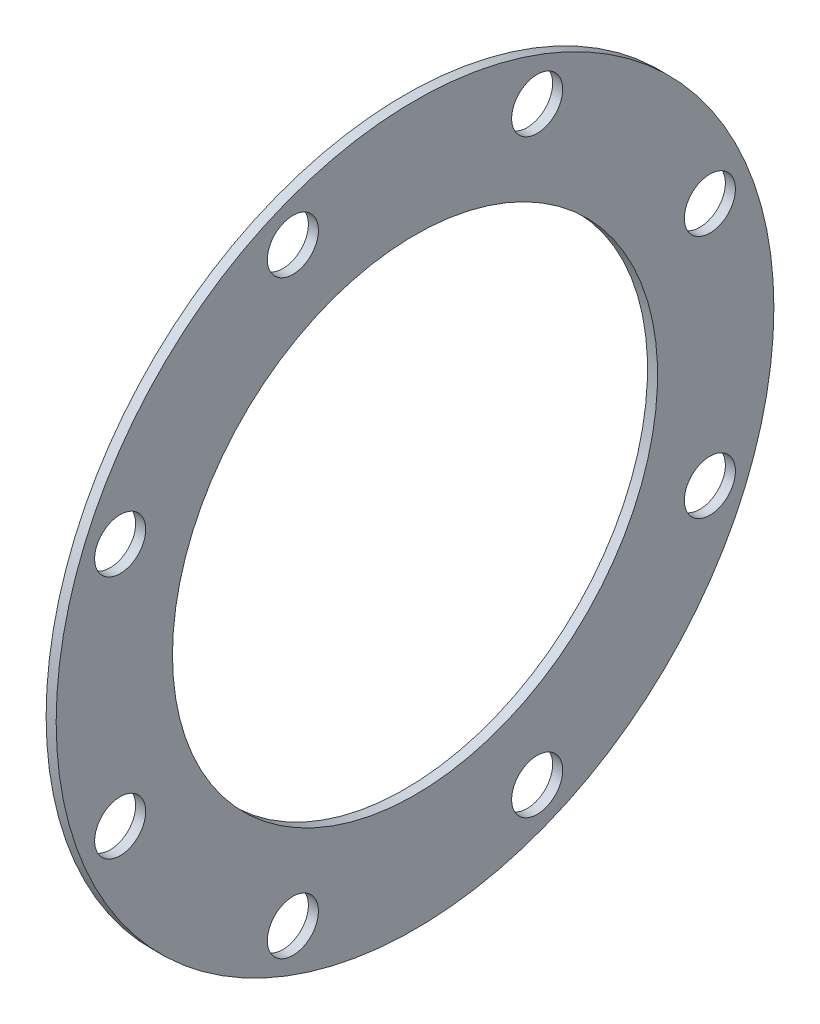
ISO-10303-21;
HEADER;
FILE_DESCRIPTION(('STEP AP214'),'2;1');
FILE_NAME('part.step','',(''),(''),'','','');
FILE_SCHEMA(('AUTOMOTIVE_DESIGN { 1 0 10303 214 1 1 1 1 }'));
ENDSEC;
DATA;
#1=APPLICATION_CONTEXT('core data for automotive mechanical design processes');
#2=APPLICATION_PROTOCOL_DEFINITION('international standard','automotive_design',2000,#1);
#3=PRODUCT_CONTEXT('',#1,'mechanical');
#4=PRODUCT('Part','Part','',(#3));
#5=PRODUCT_RELATED_PRODUCT_CATEGORY('part','',(#4));
#6=PRODUCT_DEFINITION_FORMATION('','',#4);
#7=PRODUCT_DEFINITION_CONTEXT('part definition',#1,'design');
#8=PRODUCT_DEFINITION('design','',#6,#7);
#9=PRODUCT_DEFINITION_SHAPE('','',#8);
#10=(LENGTH_UNIT() NAMED_UNIT(*) SI_UNIT(.MILLI.,.METRE.));
#11=(NAMED_UNIT(*) PLANE_ANGLE_UNIT() SI_UNIT($,.RADIAN.));
#12=(NAMED_UNIT(*) SI_UNIT($,.STERADIAN.) SOLID_ANGLE_UNIT());
#13=UNCERTAINTY_MEASURE_WITH_UNIT(LENGTH_MEASURE(1.E-05),#10,'distance_accuracy_value','');
#14=(GEOMETRIC_REPRESENTATION_CONTEXT(3) GLOBAL_UNCERTAINTY_ASSIGNED_CONTEXT((#13)) GLOBAL_UNIT_ASSIGNED_CONTEXT((#10,
#11,#12)) REPRESENTATION_CONTEXT('',''));
#15=CARTESIAN_POINT('',(0.,0.,0.));
#16=DIRECTION('',(0.,0.,1.));
#17=DIRECTION('',(1.,0.,0.));
#18=AXIS2_PLACEMENT_3D('',#15,#16,#17);
#19=CARTESIAN_POINT('',(0.,120.65,0.));
#20=DIRECTION('',(1.,0.,0.));
#21=DIRECTION('',(0.,0.,-1.));
#22=AXIS2_PLACEMENT_3D('',#19,#20,#21);
#23=PLANE('',#22);
#24=CARTESIAN_POINT('',(0.,146.665875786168,-60.7509948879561));
#25=DIRECTION('',(-1.,0.,0.));
#26=DIRECTION('',(0.,0.707106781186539,0.707106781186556));
#27=AXIS2_PLACEMENT_3D('',#24,#25,#26);
#28=CIRCLE('',#27,12.7);
#29=CARTESIAN_POINT('',(0.,155.646131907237,-51.7707387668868));
#30=VERTEX_POINT('',#29);
#31=EDGE_CURVE('E437',#30,#30,#28,.T.);
#32=ORIENTED_EDGE('',*,*,#31,.F.);
#33=EDGE_LOOP('',(#32));
#34=FACE_BOUND('',#33,.T.);
#35=CARTESIAN_POINT('',(0.,60.7509948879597,-146.665875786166));
#36=DIRECTION('',(-1.,0.,0.));
#37=DIRECTION('',(0.,1.,0.));
#38=AXIS2_PLACEMENT_3D('',#35,#36,#37);
#39=CIRCLE('',#38,12.7);
#40=CARTESIAN_POINT('',(0.,73.4509948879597,-146.665875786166));
#41=VERTEX_POINT('',#40);
#42=EDGE_CURVE('E431',#41,#41,#39,.T.);
#43=ORIENTED_EDGE('',*,*,#42,.F.);
#44=EDGE_LOOP('',(#43));
#45=FACE_BOUND('',#44,.T.);
#46=CARTESIAN_POINT('',(0.,-60.7509948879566,-146.665875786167));
#47=DIRECTION('',(-1.,0.,0.));
#48=DIRECTION('',(0.,0.707106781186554,-0.707106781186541));
#49=AXIS2_PLACEMENT_3D('',#46,#47,#48);
#50=CIRCLE('',#49,12.7);
#51=CARTESIAN_POINT('',(0.,-51.7707387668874,-155.646131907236));
#52=VERTEX_POINT('',#51);
#53=EDGE_CURVE('E425',#52,#52,#50,.T.);
#54=ORIENTED_EDGE('',*,*,#53,.F.);
#55=EDGE_LOOP('',(#54));
#56=FACE_BOUND('',#55,.T.);
#57=CARTESIAN_POINT('',(0.,-146.665875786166,-60.7509948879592));
#58=DIRECTION('',(-1.,0.,0.));
#59=DIRECTION('',(0.,0.,-1.));
#60=AXIS2_PLACEMENT_3D('',#57,#58,#59);
#61=CIRCLE('',#60,12.7);
#62=CARTESIAN_POINT('',(0.,-146.665875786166,-73.4509948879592));
#63=VERTEX_POINT('',#62);
#64=EDGE_CURVE('E419',#63,#63,#61,.T.);
#65=ORIENTED_EDGE('',*,*,#64,.F.);
#66=EDGE_LOOP('',(#65));
#67=FACE_BOUND('',#66,.T.);
#68=CARTESIAN_POINT('',(0.,-146.665875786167,60.7509948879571));
#69=DIRECTION('',(-1.,0.,0.));
#70=DIRECTION('',(0.,-0.707106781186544,-0.707106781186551));
#71=AXIS2_PLACEMENT_3D('',#68,#69,#70);
#72=CIRCLE('',#71,12.7);
#73=CARTESIAN_POINT('',(0.,-155.646131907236,51.7707387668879));
#74=VERTEX_POINT('',#73);
#75=EDGE_CURVE('E413',#74,#74,#72,.T.);
#76=ORIENTED_EDGE('',*,*,#75,.F.);
#77=EDGE_LOOP('',(#76));
#78=FACE_BOUND('',#77,.T.);
#79=CARTESIAN_POINT('',(0.,-60.7509948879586,146.665875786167));
#80=DIRECTION('',(-1.,0.,0.));
#81=DIRECTION('',(0.,-1.,0.));
#82=AXIS2_PLACEMENT_3D('',#79,#80,#81);
#83=CIRCLE('',#82,12.7);
#84=CARTESIAN_POINT('',(0.,-73.4509948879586,146.665875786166));
#85=VERTEX_POINT('',#84);
#86=EDGE_CURVE('E407',#85,#85,#83,.T.);
#87=ORIENTED_EDGE('',*,*,#86,.F.);
#88=EDGE_LOOP('',(#87));
#89=FACE_BOUND('',#88,.T.);
#90=CARTESIAN_POINT('',(0.,60.7509948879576,146.665875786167));
#91=DIRECTION('',(-1.,0.,0.));
#92=DIRECTION('',(0.,-0.707106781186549,0.707106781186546));
#93=AXIS2_PLACEMENT_3D('',#90,#91,#92);
#94=CIRCLE('',#93,12.7);
#95=CARTESIAN_POINT('',(0.,51.7707387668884,155.646131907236));
#96=VERTEX_POINT('',#95);
#97=EDGE_CURVE('E401',#96,#96,#94,.T.);
#98=ORIENTED_EDGE('',*,*,#97,.F.);
#99=EDGE_LOOP('',(#98));
#100=FACE_BOUND('',#99,.T.);
#101=CARTESIAN_POINT('',(0.,146.665875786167,60.7509948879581));
#102=DIRECTION('',(-1.,0.,0.));
#103=DIRECTION('',(0.,0.,1.));
#104=AXIS2_PLACEMENT_3D('',#101,#102,#103);
#105=CIRCLE('',#104,12.7);
#106=CARTESIAN_POINT('',(0.,146.665875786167,73.4509948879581));
#107=VERTEX_POINT('',#106);
#108=EDGE_CURVE('E395',#107,#107,#105,.T.);
#109=ORIENTED_EDGE('',*,*,#108,.F.);
#110=EDGE_LOOP('',(#109));
#111=FACE_BOUND('',#110,.T.);
#112=CARTESIAN_POINT('',(0.,0.,0.));
#113=DIRECTION('',(-1.,0.,0.));
#114=DIRECTION('',(0.,0.,1.));
#115=AXIS2_PLACEMENT_3D('',#112,#113,#114);
#116=CIRCLE('',#115,120.65);
#117=CARTESIAN_POINT('',(0.,0.,120.65));
#118=VERTEX_POINT('',#117);
#119=EDGE_CURVE('E387',#118,#118,#116,.T.);
#120=ORIENTED_EDGE('',*,*,#119,.F.);
#121=EDGE_LOOP('',(#120));
#122=FACE_BOUND('',#121,.T.);
#123=CARTESIAN_POINT('',(0.,0.,0.));
#124=DIRECTION('',(-1.,0.,0.));
#125=DIRECTION('',(0.,0.,1.));
#126=AXIS2_PLACEMENT_3D('',#123,#124,#125);
#127=CIRCLE('',#126,178.5);
#128=CARTESIAN_POINT('',(0.,0.,178.5));
#129=VERTEX_POINT('',#128);
#130=EDGE_CURVE('E10',#129,#129,#127,.T.);
#131=ORIENTED_EDGE('',*,*,#130,.T.);
#132=EDGE_LOOP('',(#131));
#133=FACE_BOUND('',#132,.T.);
#134=ADVANCED_FACE('F373',(#34,#45,#56,#67,#78,#89,#100,#111,#122,#133),#23,.F.);
#135=CARTESIAN_POINT('',(0.,0.,0.));
#136=DIRECTION('',(-1.,0.,0.));
#137=DIRECTION('',(0.,0.,1.));
#138=AXIS2_PLACEMENT_3D('',#135,#136,#137);
#139=CYLINDRICAL_SURFACE('',#138,178.5);
#140=ORIENTED_EDGE('',*,*,#130,.F.);
#141=EDGE_LOOP('',(#140));
#142=FACE_BOUND('',#141,.T.);
#143=CARTESIAN_POINT('',(5.,0.,0.));
#144=DIRECTION('',(-1.,0.,0.));
#145=DIRECTION('',(0.,0.,1.));
#146=AXIS2_PLACEMENT_3D('',#143,#144,#145);
#147=CIRCLE('',#146,178.5);
#148=CARTESIAN_POINT('',(5.,0.,178.5));
#149=VERTEX_POINT('',#148);
#150=EDGE_CURVE('E379',#149,#149,#147,.T.);
#151=ORIENTED_EDGE('',*,*,#150,.T.);
#152=EDGE_LOOP('',(#151));
#153=FACE_BOUND('',#152,.T.);
#154=ADVANCED_FACE('F445',(#142,#153),#139,.T.);
#155=CARTESIAN_POINT('',(5.00000000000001,178.5,0.));
#156=DIRECTION('',(-1.,0.,0.));
#157=DIRECTION('',(0.,0.,1.));
#158=AXIS2_PLACEMENT_3D('',#155,#156,#157);
#159=PLANE('',#158);
#160=CARTESIAN_POINT('',(5.00000000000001,146.665875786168,-60.7509948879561));
#161=DIRECTION('',(-1.,0.,0.));
#162=DIRECTION('',(0.,0.707106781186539,0.707106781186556));
#163=AXIS2_PLACEMENT_3D('',#160,#161,#162);
#164=CIRCLE('',#163,12.7);
#165=CARTESIAN_POINT('',(5.00000000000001,155.646131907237,-51.7707387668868));
#166=VERTEX_POINT('',#165);
#167=EDGE_CURVE('E434',#166,#166,#164,.T.);
#168=ORIENTED_EDGE('',*,*,#167,.T.);
#169=EDGE_LOOP('',(#168));
#170=FACE_BOUND('',#169,.T.);
#171=CARTESIAN_POINT('',(5.00000000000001,60.7509948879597,-146.665875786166));
#172=DIRECTION('',(-1.,0.,0.));
#173=DIRECTION('',(0.,1.,0.));
#174=AXIS2_PLACEMENT_3D('',#171,#172,#173);
#175=CIRCLE('',#174,12.7);
#176=CARTESIAN_POINT('',(5.00000000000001,73.4509948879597,-146.665875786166));
#177=VERTEX_POINT('',#176);
#178=EDGE_CURVE('E428',#177,#177,#175,.T.);
#179=ORIENTED_EDGE('',*,*,#178,.T.);
#180=EDGE_LOOP('',(#179));
#181=FACE_BOUND('',#180,.T.);
#182=CARTESIAN_POINT('',(5.00000000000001,-60.7509948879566,-146.665875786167));
#183=DIRECTION('',(-1.,0.,0.));
#184=DIRECTION('',(0.,0.707106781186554,-0.707106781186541));
#185=AXIS2_PLACEMENT_3D('',#182,#183,#184);
#186=CIRCLE('',#185,12.7);
#187=CARTESIAN_POINT('',(5.00000000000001,-51.7707387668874,-155.646131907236));
#188=VERTEX_POINT('',#187);
#189=EDGE_CURVE('E422',#188,#188,#186,.T.);
#190=ORIENTED_EDGE('',*,*,#189,.T.);
#191=EDGE_LOOP('',(#190));
#192=FACE_BOUND('',#191,.T.);
#193=CARTESIAN_POINT('',(5.00000000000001,-146.665875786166,-60.7509948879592));
#194=DIRECTION('',(-1.,0.,0.));
#195=DIRECTION('',(0.,0.,-1.));
#196=AXIS2_PLACEMENT_3D('',#193,#194,#195);
#197=CIRCLE('',#196,12.7);
#198=CARTESIAN_POINT('',(5.00000000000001,-146.665875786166,-73.4509948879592));
#199=VERTEX_POINT('',#198);
#200=EDGE_CURVE('E416',#199,#199,#197,.T.);
#201=ORIENTED_EDGE('',*,*,#200,.T.);
#202=EDGE_LOOP('',(#201));
#203=FACE_BOUND('',#202,.T.);
#204=CARTESIAN_POINT('',(5.00000000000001,-146.665875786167,60.7509948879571));
#205=DIRECTION('',(-1.,0.,0.));
#206=DIRECTION('',(0.,-0.707106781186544,-0.707106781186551));
#207=AXIS2_PLACEMENT_3D('',#204,#205,#206);
#208=CIRCLE('',#207,12.7);
#209=CARTESIAN_POINT('',(5.00000000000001,-155.646131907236,51.7707387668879));
#210=VERTEX_POINT('',#209);
#211=EDGE_CURVE('E410',#210,#210,#208,.T.);
#212=ORIENTED_EDGE('',*,*,#211,.T.);
#213=EDGE_LOOP('',(#212));
#214=FACE_BOUND('',#213,.T.);
#215=CARTESIAN_POINT('',(5.00000000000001,-60.7509948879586,146.665875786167));
#216=DIRECTION('',(-1.,0.,0.));
#217=DIRECTION('',(0.,-1.,0.));
#218=AXIS2_PLACEMENT_3D('',#215,#216,#217);
#219=CIRCLE('',#218,12.7);
#220=CARTESIAN_POINT('',(5.00000000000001,-73.4509948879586,146.665875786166));
#221=VERTEX_POINT('',#220);
#222=EDGE_CURVE('E404',#221,#221,#219,.T.);
#223=ORIENTED_EDGE('',*,*,#222,.T.);
#224=EDGE_LOOP('',(#223));
#225=FACE_BOUND('',#224,.T.);
#226=CARTESIAN_POINT('',(5.00000000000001,60.7509948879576,146.665875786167));
#227=DIRECTION('',(-1.,0.,0.));
#228=DIRECTION('',(0.,-0.707106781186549,0.707106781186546));
#229=AXIS2_PLACEMENT_3D('',#226,#227,#228);
#230=CIRCLE('',#229,12.7);
#231=CARTESIAN_POINT('',(5.00000000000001,51.7707387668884,155.646131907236));
#232=VERTEX_POINT('',#231);
#233=EDGE_CURVE('E398',#232,#232,#230,.T.);
#234=ORIENTED_EDGE('',*,*,#233,.T.);
#235=EDGE_LOOP('',(#234));
#236=FACE_BOUND('',#235,.T.);
#237=CARTESIAN_POINT('',(5.00000000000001,146.665875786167,60.7509948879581));
#238=DIRECTION('',(-1.,0.,0.));
#239=DIRECTION('',(0.,0.,1.));
#240=AXIS2_PLACEMENT_3D('',#237,#238,#239);
#241=CIRCLE('',#240,12.7);
#242=CARTESIAN_POINT('',(5.00000000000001,146.665875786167,73.4509948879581));
#243=VERTEX_POINT('',#242);
#244=EDGE_CURVE('E392',#243,#243,#241,.T.);
#245=ORIENTED_EDGE('',*,*,#244,.T.);
#246=EDGE_LOOP('',(#245));
#247=FACE_BOUND('',#246,.T.);
#248=ORIENTED_EDGE('',*,*,#150,.F.);
#249=EDGE_LOOP('',(#248));
#250=FACE_BOUND('',#249,.T.);
#251=CARTESIAN_POINT('',(5.00000000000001,0.,0.));
#252=DIRECTION('',(-1.,0.,0.));
#253=DIRECTION('',(0.,0.,1.));
#254=AXIS2_PLACEMENT_3D('',#251,#252,#253);
#255=CIRCLE('',#254,120.65);
#256=CARTESIAN_POINT('',(5.00000000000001,0.,120.65));
#257=VERTEX_POINT('',#256);
#258=EDGE_CURVE('E383',#257,#257,#255,.T.);
#259=ORIENTED_EDGE('',*,*,#258,.T.);
#260=EDGE_LOOP('',(#259));
#261=FACE_BOUND('',#260,.T.);
#262=ADVANCED_FACE('F465',(#170,#181,#192,#203,#214,#225,#236,#247,#250,#261),#159,.F.);
#263=CARTESIAN_POINT('',(0.,0.,0.));
#264=DIRECTION('',(-1.,0.,0.));
#265=DIRECTION('',(0.,0.,1.));
#266=AXIS2_PLACEMENT_3D('',#263,#264,#265);
#267=CYLINDRICAL_SURFACE('',#266,120.65);
#268=ORIENTED_EDGE('',*,*,#258,.F.);
#269=EDGE_LOOP('',(#268));
#270=FACE_BOUND('',#269,.T.);
#271=ORIENTED_EDGE('',*,*,#119,.T.);
#272=EDGE_LOOP('',(#271));
#273=FACE_BOUND('',#272,.T.);
#274=ADVANCED_FACE('F462',(#270,#273),#267,.F.);
#275=CARTESIAN_POINT('',(5.00000000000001,146.665875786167,60.7509948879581));
#276=DIRECTION('',(-1.,0.,0.));
#277=DIRECTION('',(0.,0.,1.));
#278=AXIS2_PLACEMENT_3D('',#275,#276,#277);
#279=CYLINDRICAL_SURFACE('',#278,12.7);
#280=ORIENTED_EDGE('',*,*,#244,.F.);
#281=EDGE_LOOP('',(#280));
#282=FACE_BOUND('',#281,.T.);
#283=ORIENTED_EDGE('',*,*,#108,.T.);
#284=EDGE_LOOP('',(#283));
#285=FACE_BOUND('',#284,.T.);
#286=ADVANCED_FACE('F464',(#282,#285),#279,.F.);
#287=CARTESIAN_POINT('',(5.00000000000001,60.7509948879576,146.665875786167));
#288=DIRECTION('',(-1.,0.,0.));
#289=DIRECTION('',(0.,0.,1.));
#290=AXIS2_PLACEMENT_3D('',#287,#288,#289);
#291=CYLINDRICAL_SURFACE('',#290,12.7);
#292=ORIENTED_EDGE('',*,*,#233,.F.);
#293=EDGE_LOOP('',(#292));
#294=FACE_BOUND('',#293,.T.);
#295=ORIENTED_EDGE('',*,*,#97,.T.);
#296=EDGE_LOOP('',(#295));
#297=FACE_BOUND('',#296,.T.);
#298=ADVANCED_FACE('F472',(#294,#297),#291,.F.);
#299=CARTESIAN_POINT('',(5.00000000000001,-60.7509948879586,146.665875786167));
#300=DIRECTION('',(-1.,0.,0.));
#301=DIRECTION('',(0.,0.,1.));
#302=AXIS2_PLACEMENT_3D('',#299,#300,#301);
#303=CYLINDRICAL_SURFACE('',#302,12.7);
#304=ORIENTED_EDGE('',*,*,#222,.F.);
#305=EDGE_LOOP('',(#304));
#306=FACE_BOUND('',#305,.T.);
#307=ORIENTED_EDGE('',*,*,#86,.T.);
#308=EDGE_LOOP('',(#307));
#309=FACE_BOUND('',#308,.T.);
#310=ADVANCED_FACE('F503',(#306,#309),#303,.F.);
#311=CARTESIAN_POINT('',(5.00000000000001,-146.665875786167,60.7509948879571));
#312=DIRECTION('',(-1.,0.,0.));
#313=DIRECTION('',(0.,0.,1.));
#314=AXIS2_PLACEMENT_3D('',#311,#312,#313);
#315=CYLINDRICAL_SURFACE('',#314,12.7);
#316=ORIENTED_EDGE('',*,*,#211,.F.);
#317=EDGE_LOOP('',(#316));
#318=FACE_BOUND('',#317,.T.);
#319=ORIENTED_EDGE('',*,*,#75,.T.);
#320=EDGE_LOOP('',(#319));
#321=FACE_BOUND('',#320,.T.);
#322=ADVANCED_FACE('F510',(#318,#321),#315,.F.);
#323=CARTESIAN_POINT('',(5.00000000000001,-146.665875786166,-60.7509948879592));
#324=DIRECTION('',(-1.,0.,0.));
#325=DIRECTION('',(0.,0.,1.));
#326=AXIS2_PLACEMENT_3D('',#323,#324,#325);
#327=CYLINDRICAL_SURFACE('',#326,12.7);
#328=ORIENTED_EDGE('',*,*,#200,.F.);
#329=EDGE_LOOP('',(#328));
#330=FACE_BOUND('',#329,.T.);
#331=ORIENTED_EDGE('',*,*,#64,.T.);
#332=EDGE_LOOP('',(#331));
#333=FACE_BOUND('',#332,.T.);
#334=ADVANCED_FACE('F518',(#330,#333),#327,.F.);
#335=CARTESIAN_POINT('',(5.00000000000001,-60.7509948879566,-146.665875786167));
#336=DIRECTION('',(-1.,0.,0.));
#337=DIRECTION('',(0.,0.,1.));
#338=AXIS2_PLACEMENT_3D('',#335,#336,#337);
#339=CYLINDRICAL_SURFACE('',#338,12.7);
#340=ORIENTED_EDGE('',*,*,#189,.F.);
#341=EDGE_LOOP('',(#340));
#342=FACE_BOUND('',#341,.T.);
#343=ORIENTED_EDGE('',*,*,#53,.T.);
#344=EDGE_LOOP('',(#343));
#345=FACE_BOUND('',#344,.T.);
#346=ADVANCED_FACE('F526',(#342,#345),#339,.F.);
#347=CARTESIAN_POINT('',(5.00000000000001,60.7509948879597,-146.665875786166));
#348=DIRECTION('',(-1.,0.,0.));
#349=DIRECTION('',(0.,0.,1.));
#350=AXIS2_PLACEMENT_3D('',#347,#348,#349);
#351=CYLINDRICAL_SURFACE('',#350,12.7);
#352=ORIENTED_EDGE('',*,*,#178,.F.);
#353=EDGE_LOOP('',(#352));
#354=FACE_BOUND('',#353,.T.);
#355=ORIENTED_EDGE('',*,*,#42,.T.);
#356=EDGE_LOOP('',(#355));
#357=FACE_BOUND('',#356,.T.);
#358=ADVANCED_FACE('F534',(#354,#357),#351,.F.);
#359=CARTESIAN_POINT('',(5.00000000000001,146.665875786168,-60.7509948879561));
#360=DIRECTION('',(-1.,0.,0.));
#361=DIRECTION('',(0.,0.,1.));
#362=AXIS2_PLACEMENT_3D('',#359,#360,#361);
#363=CYLINDRICAL_SURFACE('',#362,12.7);
#364=ORIENTED_EDGE('',*,*,#167,.F.);
#365=EDGE_LOOP('',(#364));
#366=FACE_BOUND('',#365,.T.);
#367=ORIENTED_EDGE('',*,*,#31,.T.);
#368=EDGE_LOOP('',(#367));
#369=FACE_BOUND('',#368,.T.);
#370=ADVANCED_FACE('F441',(#366,#369),#363,.F.);
#371=CLOSED_SHELL('',(#134,#154,#262,#274,#286,#298,#310,#322,#334,#346,#358,#370));
#372=MANIFOLD_SOLID_BREP('B2',#371);
#373=ADVANCED_BREP_SHAPE_REPRESENTATION('',(#18,#372),#14);
#374=SHAPE_DEFINITION_REPRESENTATION(#9,#373);
ENDSEC;
END-ISO-10303-21;
